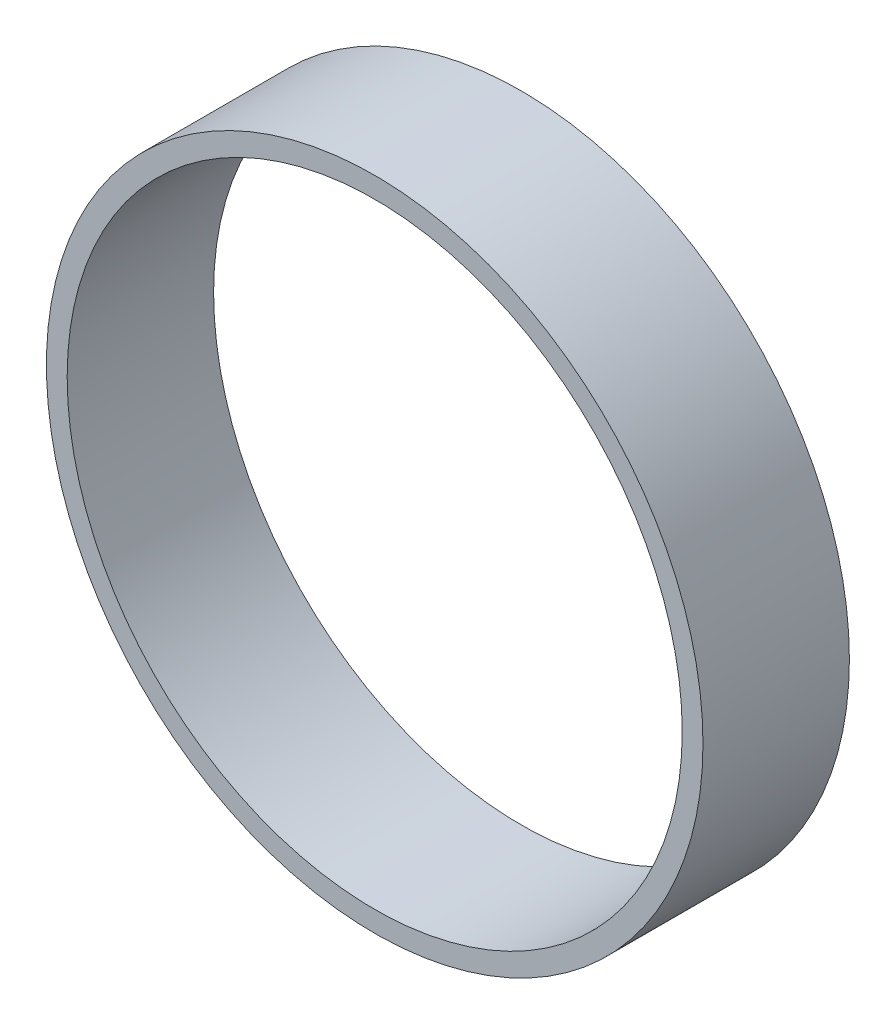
from build123d import *

# Parameters (mm, degrees)
SKETCH1_R      = 56.95
SKETCH1_R_2    = 53.35
BASEPIPE_DEPTH = 12.7


with BuildPart() as part:
    # Sketch1 → BasePipe (new, symmetric)
    with BuildSketch(Plane.XY):
        Circle(SKETCH1_R)
        Circle(SKETCH1_R_2, mode=Mode.SUBTRACT)
    extrude(amount=BASEPIPE_DEPTH, both=True)


solid = part.part
